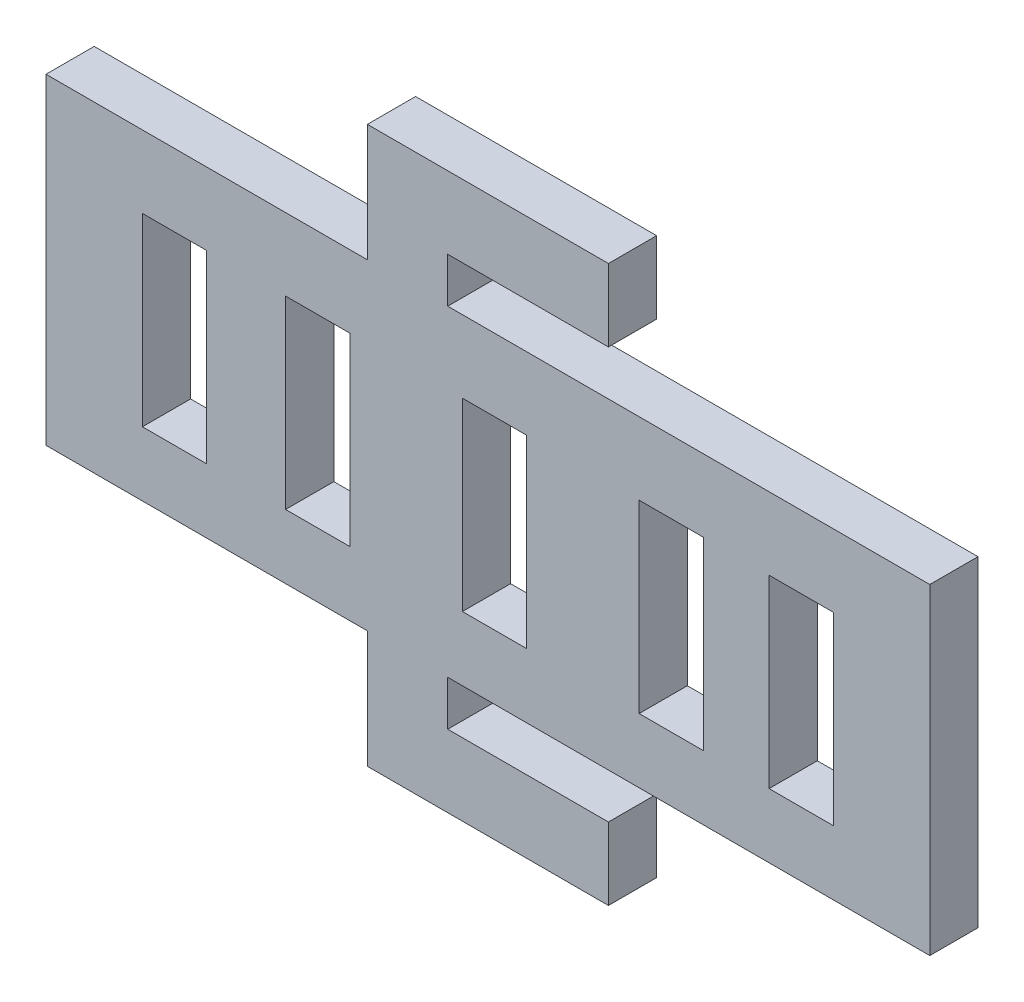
ISO-10303-21;
HEADER;
FILE_DESCRIPTION(('STEP AP214'),'2;1');
FILE_NAME('part.step','',(''),(''),'','','');
FILE_SCHEMA(('AUTOMOTIVE_DESIGN { 1 0 10303 214 1 1 1 1 }'));
ENDSEC;
DATA;
#1=APPLICATION_CONTEXT('core data for automotive mechanical design processes');
#2=APPLICATION_PROTOCOL_DEFINITION('international standard','automotive_design',2000,#1);
#3=PRODUCT_CONTEXT('',#1,'mechanical');
#4=PRODUCT('Part','Part','',(#3));
#5=PRODUCT_RELATED_PRODUCT_CATEGORY('part','',(#4));
#6=PRODUCT_DEFINITION_FORMATION('','',#4);
#7=PRODUCT_DEFINITION_CONTEXT('part definition',#1,'design');
#8=PRODUCT_DEFINITION('design','',#6,#7);
#9=PRODUCT_DEFINITION_SHAPE('','',#8);
#10=(LENGTH_UNIT() NAMED_UNIT(*) SI_UNIT(.MILLI.,.METRE.));
#11=(NAMED_UNIT(*) PLANE_ANGLE_UNIT() SI_UNIT($,.RADIAN.));
#12=(NAMED_UNIT(*) SI_UNIT($,.STERADIAN.) SOLID_ANGLE_UNIT());
#13=UNCERTAINTY_MEASURE_WITH_UNIT(LENGTH_MEASURE(1.E-05),#10,'distance_accuracy_value','');
#14=(GEOMETRIC_REPRESENTATION_CONTEXT(3) GLOBAL_UNCERTAINTY_ASSIGNED_CONTEXT((#13)) GLOBAL_UNIT_ASSIGNED_CONTEXT((#10,
#11,#12)) REPRESENTATION_CONTEXT('',''));
#15=CARTESIAN_POINT('',(0.,0.,0.));
#16=DIRECTION('',(0.,0.,1.));
#17=DIRECTION('',(1.,0.,0.));
#18=AXIS2_PLACEMENT_3D('',#15,#16,#17);
#19=CARTESIAN_POINT('',(0.,5.50000000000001,3.));
#20=DIRECTION('',(0.,1.,0.));
#21=DIRECTION('',(-1.,0.,0.));
#22=AXIS2_PLACEMENT_3D('',#19,#20,#21);
#23=PLANE('',#22);
#24=DIRECTION('',(1.,0.,0.));
#25=VECTOR('',#24,1.);
#26=CARTESIAN_POINT('',(0.,5.50000000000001,0.));
#27=LINE('',#26,#25);
#28=CARTESIAN_POINT('',(17.5,5.5,0.));
#29=VERTEX_POINT('',#28);
#30=CARTESIAN_POINT('',(21.5,5.5,0.));
#31=VERTEX_POINT('',#30);
#32=EDGE_CURVE('E432',#29,#31,#27,.T.);
#33=ORIENTED_EDGE('',*,*,#32,.T.);
#34=DIRECTION('',(0.,0.,-1.));
#35=VECTOR('',#34,1.);
#36=CARTESIAN_POINT('',(21.5,5.5,3.));
#37=LINE('',#36,#35);
#38=CARTESIAN_POINT('',(21.5,5.5,3.));
#39=VERTEX_POINT('',#38);
#40=EDGE_CURVE('E11',#39,#31,#37,.T.);
#41=ORIENTED_EDGE('',*,*,#40,.F.);
#42=DIRECTION('',(1.,0.,0.));
#43=VECTOR('',#42,1.);
#44=CARTESIAN_POINT('',(0.,5.50000000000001,3.));
#45=LINE('',#44,#43);
#46=CARTESIAN_POINT('',(17.5,5.5,3.));
#47=VERTEX_POINT('',#46);
#48=EDGE_CURVE('E294',#47,#39,#45,.T.);
#49=ORIENTED_EDGE('',*,*,#48,.F.);
#50=DIRECTION('',(0.,0.,-1.));
#51=VECTOR('',#50,1.);
#52=CARTESIAN_POINT('',(17.5,5.5,3.));
#53=LINE('',#52,#51);
#54=EDGE_CURVE('E65',#47,#29,#53,.T.);
#55=ORIENTED_EDGE('',*,*,#54,.T.);
#56=EDGE_LOOP('',(#33,#41,#49,#55));
#57=FACE_BOUND('',#56,.T.);
#58=ADVANCED_FACE('F45',(#57),#23,.F.);
#59=CARTESIAN_POINT('',(21.5,0.,3.));
#60=DIRECTION('',(1.,0.,0.));
#61=DIRECTION('',(0.,0.,-1.));
#62=AXIS2_PLACEMENT_3D('',#59,#60,#61);
#63=PLANE('',#62);
#64=DIRECTION('',(0.,-1.,0.));
#65=VECTOR('',#64,1.);
#66=CARTESIAN_POINT('',(21.5,0.,0.));
#67=LINE('',#66,#65);
#68=CARTESIAN_POINT('',(21.5,-6.,0.));
#69=VERTEX_POINT('',#68);
#70=EDGE_CURVE('E301',#31,#69,#67,.T.);
#71=ORIENTED_EDGE('',*,*,#70,.T.);
#72=DIRECTION('',(0.,0.,-1.));
#73=VECTOR('',#72,1.);
#74=CARTESIAN_POINT('',(21.5,-6.,3.));
#75=LINE('',#74,#73);
#76=CARTESIAN_POINT('',(21.5,-6.,3.));
#77=VERTEX_POINT('',#76);
#78=EDGE_CURVE('E56',#77,#69,#75,.T.);
#79=ORIENTED_EDGE('',*,*,#78,.F.);
#80=DIRECTION('',(0.,-1.,0.));
#81=VECTOR('',#80,1.);
#82=CARTESIAN_POINT('',(21.5,0.,3.));
#83=LINE('',#82,#81);
#84=EDGE_CURVE('E288',#39,#77,#83,.T.);
#85=ORIENTED_EDGE('',*,*,#84,.F.);
#86=ORIENTED_EDGE('',*,*,#40,.T.);
#87=EDGE_LOOP('',(#71,#79,#85,#86));
#88=FACE_BOUND('',#87,.T.);
#89=ADVANCED_FACE('F300',(#88),#63,.F.);
#90=CARTESIAN_POINT('',(0.,-6.,3.));
#91=DIRECTION('',(0.,1.,0.));
#92=DIRECTION('',(0.,0.,1.));
#93=AXIS2_PLACEMENT_3D('',#90,#91,#92);
#94=PLANE('',#93);
#95=DIRECTION('',(1.,0.,0.));
#96=VECTOR('',#95,1.);
#97=CARTESIAN_POINT('',(0.,-6.,0.));
#98=LINE('',#97,#96);
#99=CARTESIAN_POINT('',(17.5,-6.,0.));
#100=VERTEX_POINT('',#99);
#101=EDGE_CURVE('E437',#100,#69,#98,.T.);
#102=ORIENTED_EDGE('',*,*,#101,.F.);
#103=DIRECTION('',(0.,0.,-1.));
#104=VECTOR('',#103,1.);
#105=CARTESIAN_POINT('',(17.5,-6.,3.));
#106=LINE('',#105,#104);
#107=CARTESIAN_POINT('',(17.5,-6.,3.));
#108=VERTEX_POINT('',#107);
#109=EDGE_CURVE('E175',#108,#100,#106,.T.);
#110=ORIENTED_EDGE('',*,*,#109,.F.);
#111=DIRECTION('',(1.,0.,0.));
#112=VECTOR('',#111,1.);
#113=CARTESIAN_POINT('',(0.,-6.,3.));
#114=LINE('',#113,#112);
#115=EDGE_CURVE('E293',#108,#77,#114,.T.);
#116=ORIENTED_EDGE('',*,*,#115,.T.);
#117=ORIENTED_EDGE('',*,*,#78,.T.);
#118=EDGE_LOOP('',(#102,#110,#116,#117));
#119=FACE_BOUND('',#118,.T.);
#120=ADVANCED_FACE('F306',(#119),#94,.T.);
#121=CARTESIAN_POINT('',(0.,5.5,3.));
#122=DIRECTION('',(0.,1.,0.));
#123=DIRECTION('',(0.,0.,1.));
#124=AXIS2_PLACEMENT_3D('',#121,#122,#123);
#125=PLANE('',#124);
#126=DIRECTION('',(1.,0.,0.));
#127=VECTOR('',#126,1.);
#128=CARTESIAN_POINT('',(0.,5.5,0.));
#129=LINE('',#128,#127);
#130=CARTESIAN_POINT('',(9.41208733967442,5.5,0.));
#131=VERTEX_POINT('',#130);
#132=CARTESIAN_POINT('',(13.4120873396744,5.5,0.));
#133=VERTEX_POINT('',#132);
#134=EDGE_CURVE('E416',#131,#133,#129,.T.);
#135=ORIENTED_EDGE('',*,*,#134,.T.);
#136=DIRECTION('',(0.,0.,-1.));
#137=VECTOR('',#136,1.);
#138=CARTESIAN_POINT('',(13.4120873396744,5.5,3.));
#139=LINE('',#138,#137);
#140=CARTESIAN_POINT('',(13.4120873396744,5.5,3.));
#141=VERTEX_POINT('',#140);
#142=EDGE_CURVE('E447',#141,#133,#139,.T.);
#143=ORIENTED_EDGE('',*,*,#142,.F.);
#144=DIRECTION('',(1.,0.,0.));
#145=VECTOR('',#144,1.);
#146=CARTESIAN_POINT('',(0.,5.5,3.));
#147=LINE('',#146,#145);
#148=CARTESIAN_POINT('',(9.41208733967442,5.5,3.));
#149=VERTEX_POINT('',#148);
#150=EDGE_CURVE('E670',#149,#141,#147,.T.);
#151=ORIENTED_EDGE('',*,*,#150,.F.);
#152=DIRECTION('',(0.,0.,-1.));
#153=VECTOR('',#152,1.);
#154=CARTESIAN_POINT('',(9.41208733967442,5.5,3.));
#155=LINE('',#154,#153);
#156=EDGE_CURVE('E450',#149,#131,#155,.T.);
#157=ORIENTED_EDGE('',*,*,#156,.T.);
#158=EDGE_LOOP('',(#135,#143,#151,#157));
#159=FACE_BOUND('',#158,.T.);
#160=ADVANCED_FACE('F701',(#159),#125,.F.);
#161=CARTESIAN_POINT('',(13.4120873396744,0.,3.));
#162=DIRECTION('',(1.,0.,0.));
#163=DIRECTION('',(0.,0.,-1.));
#164=AXIS2_PLACEMENT_3D('',#161,#162,#163);
#165=PLANE('',#164);
#166=DIRECTION('',(0.,-1.,0.));
#167=VECTOR('',#166,1.);
#168=CARTESIAN_POINT('',(13.4120873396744,0.,0.));
#169=LINE('',#168,#167);
#170=CARTESIAN_POINT('',(13.4120873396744,-6.,0.));
#171=VERTEX_POINT('',#170);
#172=EDGE_CURVE('E420',#133,#171,#169,.T.);
#173=ORIENTED_EDGE('',*,*,#172,.T.);
#174=DIRECTION('',(0.,0.,-1.));
#175=VECTOR('',#174,1.);
#176=CARTESIAN_POINT('',(13.4120873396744,-6.,3.));
#177=LINE('',#176,#175);
#178=CARTESIAN_POINT('',(13.4120873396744,-6.,3.));
#179=VERTEX_POINT('',#178);
#180=EDGE_CURVE('E457',#179,#171,#177,.T.);
#181=ORIENTED_EDGE('',*,*,#180,.F.);
#182=DIRECTION('',(0.,-1.,0.));
#183=VECTOR('',#182,1.);
#184=CARTESIAN_POINT('',(13.4120873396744,0.,3.));
#185=LINE('',#184,#183);
#186=EDGE_CURVE('E674',#141,#179,#185,.T.);
#187=ORIENTED_EDGE('',*,*,#186,.F.);
#188=ORIENTED_EDGE('',*,*,#142,.T.);
#189=EDGE_LOOP('',(#173,#181,#187,#188));
#190=FACE_BOUND('',#189,.T.);
#191=ADVANCED_FACE('F703',(#190),#165,.F.);
#192=CARTESIAN_POINT('',(0.,-6.,3.));
#193=DIRECTION('',(0.,1.,0.));
#194=DIRECTION('',(-1.,0.,0.));
#195=AXIS2_PLACEMENT_3D('',#192,#193,#194);
#196=PLANE('',#195);
#197=DIRECTION('',(1.,0.,0.));
#198=VECTOR('',#197,1.);
#199=CARTESIAN_POINT('',(0.,-6.,0.));
#200=LINE('',#199,#198);
#201=CARTESIAN_POINT('',(9.41208733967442,-6.,0.));
#202=VERTEX_POINT('',#201);
#203=EDGE_CURVE('E424',#202,#171,#200,.T.);
#204=ORIENTED_EDGE('',*,*,#203,.F.);
#205=DIRECTION('',(0.,0.,-1.));
#206=VECTOR('',#205,1.);
#207=CARTESIAN_POINT('',(9.41208733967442,-6.,3.));
#208=LINE('',#207,#206);
#209=CARTESIAN_POINT('',(9.41208733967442,-6.,3.));
#210=VERTEX_POINT('',#209);
#211=EDGE_CURVE('E453',#210,#202,#208,.T.);
#212=ORIENTED_EDGE('',*,*,#211,.F.);
#213=DIRECTION('',(1.,0.,0.));
#214=VECTOR('',#213,1.);
#215=CARTESIAN_POINT('',(0.,-6.,3.));
#216=LINE('',#215,#214);
#217=EDGE_CURVE('E677',#210,#179,#216,.T.);
#218=ORIENTED_EDGE('',*,*,#217,.T.);
#219=ORIENTED_EDGE('',*,*,#180,.T.);
#220=EDGE_LOOP('',(#204,#212,#218,#219));
#221=FACE_BOUND('',#220,.T.);
#222=ADVANCED_FACE('F696',(#221),#196,.T.);
#223=CARTESIAN_POINT('',(0.,5.5,3.));
#224=DIRECTION('',(0.,1.,0.));
#225=DIRECTION('',(0.,0.,1.));
#226=AXIS2_PLACEMENT_3D('',#223,#224,#225);
#227=PLANE('',#226);
#228=DIRECTION('',(1.,0.,0.));
#229=VECTOR('',#228,1.);
#230=CARTESIAN_POINT('',(0.,5.5,0.));
#231=LINE('',#230,#229);
#232=CARTESIAN_POINT('',(-1.58791266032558,5.5,0.));
#233=VERTEX_POINT('',#232);
#234=CARTESIAN_POINT('',(2.41208733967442,5.5,0.));
#235=VERTEX_POINT('',#234);
#236=EDGE_CURVE('E400',#233,#235,#231,.T.);
#237=ORIENTED_EDGE('',*,*,#236,.T.);
#238=DIRECTION('',(0.,0.,-1.));
#239=VECTOR('',#238,1.);
#240=CARTESIAN_POINT('',(2.41208733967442,5.5,3.));
#241=LINE('',#240,#239);
#242=CARTESIAN_POINT('',(2.41208733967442,5.5,3.));
#243=VERTEX_POINT('',#242);
#244=EDGE_CURVE('E454',#243,#235,#241,.T.);
#245=ORIENTED_EDGE('',*,*,#244,.F.);
#246=DIRECTION('',(1.,0.,0.));
#247=VECTOR('',#246,1.);
#248=CARTESIAN_POINT('',(0.,5.5,3.));
#249=LINE('',#248,#247);
#250=CARTESIAN_POINT('',(-1.58791266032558,5.5,3.));
#251=VERTEX_POINT('',#250);
#252=EDGE_CURVE('E655',#251,#243,#249,.T.);
#253=ORIENTED_EDGE('',*,*,#252,.F.);
#254=DIRECTION('',(0.,0.,-1.));
#255=VECTOR('',#254,1.);
#256=CARTESIAN_POINT('',(-1.58791266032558,5.5,3.));
#257=LINE('',#256,#255);
#258=EDGE_CURVE('E463',#251,#233,#257,.T.);
#259=ORIENTED_EDGE('',*,*,#258,.T.);
#260=EDGE_LOOP('',(#237,#245,#253,#259));
#261=FACE_BOUND('',#260,.T.);
#262=ADVANCED_FACE('F710',(#261),#227,.F.);
#263=CARTESIAN_POINT('',(2.41208733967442,0.,3.));
#264=DIRECTION('',(1.,0.,0.));
#265=DIRECTION('',(0.,1.,0.));
#266=AXIS2_PLACEMENT_3D('',#263,#264,#265);
#267=PLANE('',#266);
#268=DIRECTION('',(0.,-1.,0.));
#269=VECTOR('',#268,1.);
#270=CARTESIAN_POINT('',(2.41208733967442,0.,0.));
#271=LINE('',#270,#269);
#272=CARTESIAN_POINT('',(2.41208733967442,-6.,0.));
#273=VERTEX_POINT('',#272);
#274=EDGE_CURVE('E404',#235,#273,#271,.T.);
#275=ORIENTED_EDGE('',*,*,#274,.T.);
#276=DIRECTION('',(0.,0.,-1.));
#277=VECTOR('',#276,1.);
#278=CARTESIAN_POINT('',(2.41208733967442,-6.,3.));
#279=LINE('',#278,#277);
#280=CARTESIAN_POINT('',(2.41208733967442,-6.,3.));
#281=VERTEX_POINT('',#280);
#282=EDGE_CURVE('E470',#281,#273,#279,.T.);
#283=ORIENTED_EDGE('',*,*,#282,.F.);
#284=DIRECTION('',(0.,-1.,0.));
#285=VECTOR('',#284,1.);
#286=CARTESIAN_POINT('',(2.41208733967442,0.,3.));
#287=LINE('',#286,#285);
#288=EDGE_CURVE('E659',#243,#281,#287,.T.);
#289=ORIENTED_EDGE('',*,*,#288,.F.);
#290=ORIENTED_EDGE('',*,*,#244,.T.);
#291=EDGE_LOOP('',(#275,#283,#289,#290));
#292=FACE_BOUND('',#291,.T.);
#293=ADVANCED_FACE('F1063',(#292),#267,.F.);
#294=CARTESIAN_POINT('',(0.,-6.,3.));
#295=DIRECTION('',(0.,1.,0.));
#296=DIRECTION('',(0.,0.,1.));
#297=AXIS2_PLACEMENT_3D('',#294,#295,#296);
#298=PLANE('',#297);
#299=DIRECTION('',(1.,0.,0.));
#300=VECTOR('',#299,1.);
#301=CARTESIAN_POINT('',(0.,-6.,0.));
#302=LINE('',#301,#300);
#303=CARTESIAN_POINT('',(-1.58791266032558,-6.,0.));
#304=VERTEX_POINT('',#303);
#305=EDGE_CURVE('E408',#304,#273,#302,.T.);
#306=ORIENTED_EDGE('',*,*,#305,.F.);
#307=DIRECTION('',(0.,0.,-1.));
#308=VECTOR('',#307,1.);
#309=CARTESIAN_POINT('',(-1.58791266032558,-6.,3.));
#310=LINE('',#309,#308);
#311=CARTESIAN_POINT('',(-1.58791266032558,-6.,3.));
#312=VERTEX_POINT('',#311);
#313=EDGE_CURVE('E466',#312,#304,#310,.T.);
#314=ORIENTED_EDGE('',*,*,#313,.F.);
#315=DIRECTION('',(1.,0.,0.));
#316=VECTOR('',#315,1.);
#317=CARTESIAN_POINT('',(0.,-6.,3.));
#318=LINE('',#317,#316);
#319=EDGE_CURVE('E662',#312,#281,#318,.T.);
#320=ORIENTED_EDGE('',*,*,#319,.T.);
#321=ORIENTED_EDGE('',*,*,#282,.T.);
#322=EDGE_LOOP('',(#306,#314,#320,#321));
#323=FACE_BOUND('',#322,.T.);
#324=ADVANCED_FACE('F1053',(#323),#298,.T.);
#325=CARTESIAN_POINT('',(0.,5.5,3.));
#326=DIRECTION('',(0.,1.,0.));
#327=DIRECTION('',(0.,0.,1.));
#328=AXIS2_PLACEMENT_3D('',#325,#326,#327);
#329=PLANE('',#328);
#330=DIRECTION('',(1.,0.,0.));
#331=VECTOR('',#330,1.);
#332=CARTESIAN_POINT('',(0.,5.5,0.));
#333=LINE('',#332,#331);
#334=CARTESIAN_POINT('',(-12.5879126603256,5.5,0.));
#335=VERTEX_POINT('',#334);
#336=CARTESIAN_POINT('',(-8.58791266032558,5.5,0.));
#337=VERTEX_POINT('',#336);
#338=EDGE_CURVE('E384',#335,#337,#333,.T.);
#339=ORIENTED_EDGE('',*,*,#338,.T.);
#340=DIRECTION('',(0.,0.,-1.));
#341=VECTOR('',#340,1.);
#342=CARTESIAN_POINT('',(-8.58791266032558,5.5,3.));
#343=LINE('',#342,#341);
#344=CARTESIAN_POINT('',(-8.58791266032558,5.5,3.));
#345=VERTEX_POINT('',#344);
#346=EDGE_CURVE('E467',#345,#337,#343,.T.);
#347=ORIENTED_EDGE('',*,*,#346,.F.);
#348=DIRECTION('',(1.,0.,0.));
#349=VECTOR('',#348,1.);
#350=CARTESIAN_POINT('',(0.,5.5,3.));
#351=LINE('',#350,#349);
#352=CARTESIAN_POINT('',(-12.5879126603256,5.5,3.));
#353=VERTEX_POINT('',#352);
#354=EDGE_CURVE('E640',#353,#345,#351,.T.);
#355=ORIENTED_EDGE('',*,*,#354,.F.);
#356=DIRECTION('',(0.,0.,-1.));
#357=VECTOR('',#356,1.);
#358=CARTESIAN_POINT('',(-12.5879126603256,5.5,3.));
#359=LINE('',#358,#357);
#360=EDGE_CURVE('E476',#353,#335,#359,.T.);
#361=ORIENTED_EDGE('',*,*,#360,.T.);
#362=EDGE_LOOP('',(#339,#347,#355,#361));
#363=FACE_BOUND('',#362,.T.);
#364=ADVANCED_FACE('F1043',(#363),#329,.F.);
#365=CARTESIAN_POINT('',(-8.58791266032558,0.,3.));
#366=DIRECTION('',(1.,0.,0.));
#367=DIRECTION('',(0.,0.,-1.));
#368=AXIS2_PLACEMENT_3D('',#365,#366,#367);
#369=PLANE('',#368);
#370=DIRECTION('',(0.,-1.,0.));
#371=VECTOR('',#370,1.);
#372=CARTESIAN_POINT('',(-8.58791266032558,0.,0.));
#373=LINE('',#372,#371);
#374=CARTESIAN_POINT('',(-8.58791266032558,-6.,0.));
#375=VERTEX_POINT('',#374);
#376=EDGE_CURVE('E388',#337,#375,#373,.T.);
#377=ORIENTED_EDGE('',*,*,#376,.T.);
#378=DIRECTION('',(0.,0.,-1.));
#379=VECTOR('',#378,1.);
#380=CARTESIAN_POINT('',(-8.58791266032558,-6.,3.));
#381=LINE('',#380,#379);
#382=CARTESIAN_POINT('',(-8.58791266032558,-6.,3.));
#383=VERTEX_POINT('',#382);
#384=EDGE_CURVE('E483',#383,#375,#381,.T.);
#385=ORIENTED_EDGE('',*,*,#384,.F.);
#386=DIRECTION('',(0.,-1.,0.));
#387=VECTOR('',#386,1.);
#388=CARTESIAN_POINT('',(-8.58791266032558,0.,3.));
#389=LINE('',#388,#387);
#390=EDGE_CURVE('E644',#345,#383,#389,.T.);
#391=ORIENTED_EDGE('',*,*,#390,.F.);
#392=ORIENTED_EDGE('',*,*,#346,.T.);
#393=EDGE_LOOP('',(#377,#385,#391,#392));
#394=FACE_BOUND('',#393,.T.);
#395=ADVANCED_FACE('F1033',(#394),#369,.F.);
#396=CARTESIAN_POINT('',(0.,-6.,3.));
#397=DIRECTION('',(0.,1.,0.));
#398=DIRECTION('',(0.,0.,1.));
#399=AXIS2_PLACEMENT_3D('',#396,#397,#398);
#400=PLANE('',#399);
#401=DIRECTION('',(1.,0.,0.));
#402=VECTOR('',#401,1.);
#403=CARTESIAN_POINT('',(0.,-6.,0.));
#404=LINE('',#403,#402);
#405=CARTESIAN_POINT('',(-12.5879126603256,-6.,0.));
#406=VERTEX_POINT('',#405);
#407=EDGE_CURVE('E392',#406,#375,#404,.T.);
#408=ORIENTED_EDGE('',*,*,#407,.F.);
#409=DIRECTION('',(0.,0.,-1.));
#410=VECTOR('',#409,1.);
#411=CARTESIAN_POINT('',(-12.5879126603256,-6.,3.));
#412=LINE('',#411,#410);
#413=CARTESIAN_POINT('',(-12.5879126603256,-6.,3.));
#414=VERTEX_POINT('',#413);
#415=EDGE_CURVE('E479',#414,#406,#412,.T.);
#416=ORIENTED_EDGE('',*,*,#415,.F.);
#417=DIRECTION('',(1.,0.,0.));
#418=VECTOR('',#417,1.);
#419=CARTESIAN_POINT('',(0.,-6.,3.));
#420=LINE('',#419,#418);
#421=EDGE_CURVE('E647',#414,#383,#420,.T.);
#422=ORIENTED_EDGE('',*,*,#421,.T.);
#423=ORIENTED_EDGE('',*,*,#384,.T.);
#424=EDGE_LOOP('',(#408,#416,#422,#423));
#425=FACE_BOUND('',#424,.T.);
#426=ADVANCED_FACE('F1023',(#425),#400,.T.);
#427=CARTESIAN_POINT('',(0.,-6.,3.));
#428=DIRECTION('',(0.,-1.,0.));
#429=DIRECTION('',(1.,0.,0.));
#430=AXIS2_PLACEMENT_3D('',#427,#428,#429);
#431=PLANE('',#430);
#432=DIRECTION('',(-1.,0.,0.));
#433=VECTOR('',#432,1.);
#434=CARTESIAN_POINT('',(0.,-6.,0.));
#435=LINE('',#434,#433);
#436=CARTESIAN_POINT('',(-17.5,-6.,0.));
#437=VERTEX_POINT('',#436);
#438=CARTESIAN_POINT('',(-21.5,-6.,0.));
#439=VERTEX_POINT('',#438);
#440=EDGE_CURVE('E368',#437,#439,#435,.T.);
#441=ORIENTED_EDGE('',*,*,#440,.T.);
#442=DIRECTION('',(0.,0.,-1.));
#443=VECTOR('',#442,1.);
#444=CARTESIAN_POINT('',(-21.5,-6.,3.));
#445=LINE('',#444,#443);
#446=CARTESIAN_POINT('',(-21.5,-6.,3.));
#447=VERTEX_POINT('',#446);
#448=EDGE_CURVE('E480',#447,#439,#445,.T.);
#449=ORIENTED_EDGE('',*,*,#448,.F.);
#450=DIRECTION('',(-1.,0.,0.));
#451=VECTOR('',#450,1.);
#452=CARTESIAN_POINT('',(0.,-6.,3.));
#453=LINE('',#452,#451);
#454=CARTESIAN_POINT('',(-17.5,-6.,3.));
#455=VERTEX_POINT('',#454);
#456=EDGE_CURVE('E613',#455,#447,#453,.T.);
#457=ORIENTED_EDGE('',*,*,#456,.F.);
#458=DIRECTION('',(0.,0.,-1.));
#459=VECTOR('',#458,1.);
#460=CARTESIAN_POINT('',(-17.5,-6.,3.));
#461=LINE('',#460,#459);
#462=EDGE_CURVE('E489',#455,#437,#461,.T.);
#463=ORIENTED_EDGE('',*,*,#462,.T.);
#464=EDGE_LOOP('',(#441,#449,#457,#463));
#465=FACE_BOUND('',#464,.T.);
#466=ADVANCED_FACE('F1013',(#465),#431,.F.);
#467=CARTESIAN_POINT('',(-21.5,0.,3.));
#468=DIRECTION('',(-1.,0.,0.));
#469=DIRECTION('',(0.,-1.,0.));
#470=AXIS2_PLACEMENT_3D('',#467,#468,#469);
#471=PLANE('',#470);
#472=DIRECTION('',(0.,1.,0.));
#473=VECTOR('',#472,1.);
#474=CARTESIAN_POINT('',(-21.5,0.,0.));
#475=LINE('',#474,#473);
#476=CARTESIAN_POINT('',(-21.5,5.5,0.));
#477=VERTEX_POINT('',#476);
#478=EDGE_CURVE('E372',#439,#477,#475,.T.);
#479=ORIENTED_EDGE('',*,*,#478,.T.);
#480=DIRECTION('',(0.,0.,-1.));
#481=VECTOR('',#480,1.);
#482=CARTESIAN_POINT('',(-21.5,5.5,3.));
#483=LINE('',#482,#481);
#484=CARTESIAN_POINT('',(-21.5,5.5,3.));
#485=VERTEX_POINT('',#484);
#486=EDGE_CURVE('E495',#485,#477,#483,.T.);
#487=ORIENTED_EDGE('',*,*,#486,.F.);
#488=DIRECTION('',(0.,1.,0.));
#489=VECTOR('',#488,1.);
#490=CARTESIAN_POINT('',(-21.5,0.,3.));
#491=LINE('',#490,#489);
#492=EDGE_CURVE('E629',#447,#485,#491,.T.);
#493=ORIENTED_EDGE('',*,*,#492,.F.);
#494=ORIENTED_EDGE('',*,*,#448,.T.);
#495=EDGE_LOOP('',(#479,#487,#493,#494));
#496=FACE_BOUND('',#495,.T.);
#497=ADVANCED_FACE('F1003',(#496),#471,.F.);
#498=CARTESIAN_POINT('',(0.,5.5,3.));
#499=DIRECTION('',(0.,-1.,0.));
#500=DIRECTION('',(1.,0.,0.));
#501=AXIS2_PLACEMENT_3D('',#498,#499,#500);
#502=PLANE('',#501);
#503=DIRECTION('',(-1.,0.,0.));
#504=VECTOR('',#503,1.);
#505=CARTESIAN_POINT('',(0.,5.5,0.));
#506=LINE('',#505,#504);
#507=CARTESIAN_POINT('',(-17.5,5.5,0.));
#508=VERTEX_POINT('',#507);
#509=EDGE_CURVE('E376',#508,#477,#506,.T.);
#510=ORIENTED_EDGE('',*,*,#509,.F.);
#511=DIRECTION('',(0.,0.,-1.));
#512=VECTOR('',#511,1.);
#513=CARTESIAN_POINT('',(-17.5,5.5,3.));
#514=LINE('',#513,#512);
#515=CARTESIAN_POINT('',(-17.5,5.5,3.));
#516=VERTEX_POINT('',#515);
#517=EDGE_CURVE('E492',#516,#508,#514,.T.);
#518=ORIENTED_EDGE('',*,*,#517,.F.);
#519=DIRECTION('',(-1.,0.,0.));
#520=VECTOR('',#519,1.);
#521=CARTESIAN_POINT('',(0.,5.5,3.));
#522=LINE('',#521,#520);
#523=EDGE_CURVE('E632',#516,#485,#522,.T.);
#524=ORIENTED_EDGE('',*,*,#523,.T.);
#525=ORIENTED_EDGE('',*,*,#486,.T.);
#526=EDGE_LOOP('',(#510,#518,#524,#525));
#527=FACE_BOUND('',#526,.T.);
#528=ADVANCED_FACE('F995',(#527),#502,.T.);
#529=CARTESIAN_POINT('',(0.,-10.,3.));
#530=DIRECTION('',(0.,1.,0.));
#531=DIRECTION('',(0.,0.,1.));
#532=AXIS2_PLACEMENT_3D('',#529,#530,#531);
#533=PLANE('',#532);
#534=DIRECTION('',(1.,0.,0.));
#535=VECTOR('',#534,1.);
#536=CARTESIAN_POINT('',(0.,-10.,0.));
#537=LINE('',#536,#535);
#538=CARTESIAN_POINT('',(-27.5,-10.,0.));
#539=VERTEX_POINT('',#538);
#540=CARTESIAN_POINT('',(-7.5,-10.,0.));
#541=VERTEX_POINT('',#540);
#542=EDGE_CURVE('E315',#539,#541,#537,.T.);
#543=ORIENTED_EDGE('',*,*,#542,.T.);
#544=DIRECTION('',(0.,0.,-1.));
#545=VECTOR('',#544,1.);
#546=CARTESIAN_POINT('',(-7.5,-10.,3.));
#547=LINE('',#546,#545);
#548=CARTESIAN_POINT('',(-7.5,-10.,3.));
#549=VERTEX_POINT('',#548);
#550=EDGE_CURVE('E49',#549,#541,#547,.T.);
#551=ORIENTED_EDGE('',*,*,#550,.F.);
#552=DIRECTION('',(1.,0.,0.));
#553=VECTOR('',#552,1.);
#554=CARTESIAN_POINT('',(0.,-10.,3.));
#555=LINE('',#554,#553);
#556=CARTESIAN_POINT('',(-27.5,-10.,3.));
#557=VERTEX_POINT('',#556);
#558=EDGE_CURVE('E444',#557,#549,#555,.T.);
#559=ORIENTED_EDGE('',*,*,#558,.F.);
#560=DIRECTION('',(0.,0.,-1.));
#561=VECTOR('',#560,1.);
#562=CARTESIAN_POINT('',(-27.5,-10.,3.));
#563=LINE('',#562,#561);
#564=EDGE_CURVE('E311',#557,#539,#563,.T.);
#565=ORIENTED_EDGE('',*,*,#564,.T.);
#566=EDGE_LOOP('',(#543,#551,#559,#565));
#567=FACE_BOUND('',#566,.T.);
#568=ADVANCED_FACE('F557',(#567),#533,.F.);
#569=CARTESIAN_POINT('',(-7.50000000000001,0.,3.));
#570=DIRECTION('',(1.,0.,0.));
#571=DIRECTION('',(0.,1.,0.));
#572=AXIS2_PLACEMENT_3D('',#569,#570,#571);
#573=PLANE('',#572);
#574=DIRECTION('',(0.,-1.,0.));
#575=VECTOR('',#574,1.);
#576=CARTESIAN_POINT('',(-7.50000000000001,0.,0.));
#577=LINE('',#576,#575);
#578=CARTESIAN_POINT('',(-7.5,-17.3,0.));
#579=VERTEX_POINT('',#578);
#580=EDGE_CURVE('E319',#541,#579,#577,.T.);
#581=ORIENTED_EDGE('',*,*,#580,.T.);
#582=DIRECTION('',(0.,0.,-1.));
#583=VECTOR('',#582,1.);
#584=CARTESIAN_POINT('',(-7.5,-17.3,3.));
#585=LINE('',#584,#583);
#586=CARTESIAN_POINT('',(-7.5,-17.3,3.));
#587=VERTEX_POINT('',#586);
#588=EDGE_CURVE('E546',#587,#579,#585,.T.);
#589=ORIENTED_EDGE('',*,*,#588,.F.);
#590=DIRECTION('',(0.,-1.,0.));
#591=VECTOR('',#590,1.);
#592=CARTESIAN_POINT('',(-7.50000000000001,0.,3.));
#593=LINE('',#592,#591);
#594=EDGE_CURVE('E188',#549,#587,#593,.T.);
#595=ORIENTED_EDGE('',*,*,#594,.F.);
#596=ORIENTED_EDGE('',*,*,#550,.T.);
#597=EDGE_LOOP('',(#581,#589,#595,#596));
#598=FACE_BOUND('',#597,.T.);
#599=ADVANCED_FACE('F47',(#598),#573,.F.);
#600=CARTESIAN_POINT('',(0.,-17.3,3.));
#601=DIRECTION('',(0.,1.,0.));
#602=DIRECTION('',(0.,0.,1.));
#603=AXIS2_PLACEMENT_3D('',#600,#601,#602);
#604=PLANE('',#603);
#605=DIRECTION('',(1.,0.,0.));
#606=VECTOR('',#605,1.);
#607=CARTESIAN_POINT('',(0.,-17.3,0.));
#608=LINE('',#607,#606);
#609=CARTESIAN_POINT('',(7.5,-17.3,0.));
#610=VERTEX_POINT('',#609);
#611=EDGE_CURVE('E323',#579,#610,#608,.T.);
#612=ORIENTED_EDGE('',*,*,#611,.T.);
#613=DIRECTION('',(0.,0.,-1.));
#614=VECTOR('',#613,1.);
#615=CARTESIAN_POINT('',(7.5,-17.3,3.));
#616=LINE('',#615,#614);
#617=CARTESIAN_POINT('',(7.5,-17.3,3.));
#618=VERTEX_POINT('',#617);
#619=EDGE_CURVE('E543',#618,#610,#616,.T.);
#620=ORIENTED_EDGE('',*,*,#619,.F.);
#621=DIRECTION('',(1.,0.,0.));
#622=VECTOR('',#621,1.);
#623=CARTESIAN_POINT('',(0.,-17.3,3.));
#624=LINE('',#623,#622);
#625=EDGE_CURVE('E790',#587,#618,#624,.T.);
#626=ORIENTED_EDGE('',*,*,#625,.F.);
#627=ORIENTED_EDGE('',*,*,#588,.T.);
#628=EDGE_LOOP('',(#612,#620,#626,#627));
#629=FACE_BOUND('',#628,.T.);
#630=ADVANCED_FACE('F764',(#629),#604,.F.);
#631=CARTESIAN_POINT('',(7.5,0.,3.));
#632=DIRECTION('',(-1.,0.,0.));
#633=DIRECTION('',(0.,0.,1.));
#634=AXIS2_PLACEMENT_3D('',#631,#632,#633);
#635=PLANE('',#634);
#636=DIRECTION('',(0.,1.,0.));
#637=VECTOR('',#636,1.);
#638=CARTESIAN_POINT('',(7.5,0.,0.));
#639=LINE('',#638,#637);
#640=CARTESIAN_POINT('',(7.5,-12.8,0.));
#641=VERTEX_POINT('',#640);
#642=EDGE_CURVE('E326',#610,#641,#639,.T.);
#643=ORIENTED_EDGE('',*,*,#642,.T.);
#644=DIRECTION('',(0.,0.,-1.));
#645=VECTOR('',#644,1.);
#646=CARTESIAN_POINT('',(7.5,-12.8,3.));
#647=LINE('',#646,#645);
#648=CARTESIAN_POINT('',(7.5,-12.8,3.));
#649=VERTEX_POINT('',#648);
#650=EDGE_CURVE('E539',#649,#641,#647,.T.);
#651=ORIENTED_EDGE('',*,*,#650,.F.);
#652=DIRECTION('',(0.,1.,0.));
#653=VECTOR('',#652,1.);
#654=CARTESIAN_POINT('',(7.5,0.,3.));
#655=LINE('',#654,#653);
#656=EDGE_CURVE('E774',#618,#649,#655,.T.);
#657=ORIENTED_EDGE('',*,*,#656,.F.);
#658=ORIENTED_EDGE('',*,*,#619,.T.);
#659=EDGE_LOOP('',(#643,#651,#657,#658));
#660=FACE_BOUND('',#659,.T.);
#661=ADVANCED_FACE('F761',(#660),#635,.F.);
#662=CARTESIAN_POINT('',(0.,-12.8,3.));
#663=DIRECTION('',(0.,-1.,0.));
#664=DIRECTION('',(1.,0.,0.));
#665=AXIS2_PLACEMENT_3D('',#662,#663,#664);
#666=PLANE('',#665);
#667=DIRECTION('',(-1.,0.,0.));
#668=VECTOR('',#667,1.);
#669=CARTESIAN_POINT('',(0.,-12.8,0.));
#670=LINE('',#669,#668);
#671=CARTESIAN_POINT('',(-2.5,-12.8,0.));
#672=VERTEX_POINT('',#671);
#673=EDGE_CURVE('E329',#641,#672,#670,.T.);
#674=ORIENTED_EDGE('',*,*,#673,.T.);
#675=DIRECTION('',(0.,0.,-1.));
#676=VECTOR('',#675,1.);
#677=CARTESIAN_POINT('',(-2.5,-12.8,3.));
#678=LINE('',#677,#676);
#679=CARTESIAN_POINT('',(-2.5,-12.8,3.));
#680=VERTEX_POINT('',#679);
#681=EDGE_CURVE('E535',#680,#672,#678,.T.);
#682=ORIENTED_EDGE('',*,*,#681,.F.);
#683=DIRECTION('',(-1.,0.,0.));
#684=VECTOR('',#683,1.);
#685=CARTESIAN_POINT('',(0.,-12.8,3.));
#686=LINE('',#685,#684);
#687=EDGE_CURVE('E781',#649,#680,#686,.T.);
#688=ORIENTED_EDGE('',*,*,#687,.F.);
#689=ORIENTED_EDGE('',*,*,#650,.T.);
#690=EDGE_LOOP('',(#674,#682,#688,#689));
#691=FACE_BOUND('',#690,.T.);
#692=ADVANCED_FACE('F757',(#691),#666,.F.);
#693=CARTESIAN_POINT('',(-2.5,0.,3.));
#694=DIRECTION('',(-1.,0.,0.));
#695=DIRECTION('',(0.,0.,1.));
#696=AXIS2_PLACEMENT_3D('',#693,#694,#695);
#697=PLANE('',#696);
#698=DIRECTION('',(0.,1.,0.));
#699=VECTOR('',#698,1.);
#700=CARTESIAN_POINT('',(-2.5,0.,0.));
#701=LINE('',#700,#699);
#702=CARTESIAN_POINT('',(-2.5,-10.,0.));
#703=VERTEX_POINT('',#702);
#704=EDGE_CURVE('E332',#672,#703,#701,.T.);
#705=ORIENTED_EDGE('',*,*,#704,.T.);
#706=DIRECTION('',(0.,0.,-1.));
#707=VECTOR('',#706,1.);
#708=CARTESIAN_POINT('',(-2.5,-10.,3.));
#709=LINE('',#708,#707);
#710=CARTESIAN_POINT('',(-2.5,-10.,3.));
#711=VERTEX_POINT('',#710);
#712=EDGE_CURVE('E531',#711,#703,#709,.T.);
#713=ORIENTED_EDGE('',*,*,#712,.F.);
#714=DIRECTION('',(0.,1.,0.));
#715=VECTOR('',#714,1.);
#716=CARTESIAN_POINT('',(-2.5,0.,3.));
#717=LINE('',#716,#715);
#718=EDGE_CURVE('E779',#680,#711,#717,.T.);
#719=ORIENTED_EDGE('',*,*,#718,.F.);
#720=ORIENTED_EDGE('',*,*,#681,.T.);
#721=EDGE_LOOP('',(#705,#713,#719,#720));
#722=FACE_BOUND('',#721,.T.);
#723=ADVANCED_FACE('F751',(#722),#697,.F.);
#724=CARTESIAN_POINT('',(27.5,-10.,0.));
#725=VERTEX_POINT('',#724);
#726=EDGE_CURVE('E320',#703,#725,#537,.T.);
#727=ORIENTED_EDGE('',*,*,#726,.T.);
#728=DIRECTION('',(0.,0.,-1.));
#729=VECTOR('',#728,1.);
#730=CARTESIAN_POINT('',(27.5,-10.,3.));
#731=LINE('',#730,#729);
#732=CARTESIAN_POINT('',(27.5,-10.,3.));
#733=VERTEX_POINT('',#732);
#734=EDGE_CURVE('E527',#733,#725,#731,.T.);
#735=ORIENTED_EDGE('',*,*,#734,.F.);
#736=EDGE_CURVE('E607',#711,#733,#555,.T.);
#737=ORIENTED_EDGE('',*,*,#736,.F.);
#738=ORIENTED_EDGE('',*,*,#712,.T.);
#739=EDGE_LOOP('',(#727,#735,#737,#738));
#740=FACE_BOUND('',#739,.T.);
#741=ADVANCED_FACE('F579',(#740),#533,.F.);
#742=CARTESIAN_POINT('',(27.5,0.,3.));
#743=DIRECTION('',(-1.,0.,0.));
#744=DIRECTION('',(0.,0.,1.));
#745=AXIS2_PLACEMENT_3D('',#742,#743,#744);
#746=PLANE('',#745);
#747=DIRECTION('',(0.,1.,0.));
#748=VECTOR('',#747,1.);
#749=CARTESIAN_POINT('',(27.5,0.,0.));
#750=LINE('',#749,#748);
#751=CARTESIAN_POINT('',(27.5,10.,0.));
#752=VERTEX_POINT('',#751);
#753=EDGE_CURVE('E335',#725,#752,#750,.T.);
#754=ORIENTED_EDGE('',*,*,#753,.T.);
#755=DIRECTION('',(0.,0.,-1.));
#756=VECTOR('',#755,1.);
#757=CARTESIAN_POINT('',(27.5,10.,3.));
#758=LINE('',#757,#756);
#759=CARTESIAN_POINT('',(27.5,10.,3.));
#760=VERTEX_POINT('',#759);
#761=EDGE_CURVE('E524',#760,#752,#758,.T.);
#762=ORIENTED_EDGE('',*,*,#761,.F.);
#763=DIRECTION('',(0.,1.,0.));
#764=VECTOR('',#763,1.);
#765=CARTESIAN_POINT('',(27.5,0.,3.));
#766=LINE('',#765,#764);
#767=EDGE_CURVE('E588',#733,#760,#766,.T.);
#768=ORIENTED_EDGE('',*,*,#767,.F.);
#769=ORIENTED_EDGE('',*,*,#734,.T.);
#770=EDGE_LOOP('',(#754,#762,#768,#769));
#771=FACE_BOUND('',#770,.T.);
#772=ADVANCED_FACE('F586',(#771),#746,.F.);
#773=CARTESIAN_POINT('',(0.,10.,3.));
#774=DIRECTION('',(0.,1.,0.));
#775=DIRECTION('',(0.,0.,1.));
#776=AXIS2_PLACEMENT_3D('',#773,#774,#775);
#777=PLANE('',#776);
#778=DIRECTION('',(1.,0.,0.));
#779=VECTOR('',#778,1.);
#780=CARTESIAN_POINT('',(0.,10.,0.));
#781=LINE('',#780,#779);
#782=CARTESIAN_POINT('',(-2.5,10.,0.));
#783=VERTEX_POINT('',#782);
#784=EDGE_CURVE('E339',#783,#752,#781,.T.);
#785=ORIENTED_EDGE('',*,*,#784,.F.);
#786=DIRECTION('',(0.,0.,-1.));
#787=VECTOR('',#786,1.);
#788=CARTESIAN_POINT('',(-2.5,10.,3.));
#789=LINE('',#788,#787);
#790=CARTESIAN_POINT('',(-2.5,10.,3.));
#791=VERTEX_POINT('',#790);
#792=EDGE_CURVE('E521',#791,#783,#789,.T.);
#793=ORIENTED_EDGE('',*,*,#792,.F.);
#794=DIRECTION('',(1.,0.,0.));
#795=VECTOR('',#794,1.);
#796=CARTESIAN_POINT('',(0.,10.,3.));
#797=LINE('',#796,#795);
#798=EDGE_CURVE('E595',#791,#760,#797,.T.);
#799=ORIENTED_EDGE('',*,*,#798,.T.);
#800=ORIENTED_EDGE('',*,*,#761,.T.);
#801=EDGE_LOOP('',(#785,#793,#799,#800));
#802=FACE_BOUND('',#801,.T.);
#803=ADVANCED_FACE('F592',(#802),#777,.T.);
#804=CARTESIAN_POINT('',(-2.5,0.,3.));
#805=DIRECTION('',(1.,0.,0.));
#806=DIRECTION('',(0.,0.,-1.));
#807=AXIS2_PLACEMENT_3D('',#804,#805,#806);
#808=PLANE('',#807);
#809=DIRECTION('',(0.,-1.,0.));
#810=VECTOR('',#809,1.);
#811=CARTESIAN_POINT('',(-2.5,0.,0.));
#812=LINE('',#811,#810);
#813=CARTESIAN_POINT('',(-2.5,12.8,0.));
#814=VERTEX_POINT('',#813);
#815=EDGE_CURVE('E343',#814,#783,#812,.T.);
#816=ORIENTED_EDGE('',*,*,#815,.F.);
#817=DIRECTION('',(0.,0.,-1.));
#818=VECTOR('',#817,1.);
#819=CARTESIAN_POINT('',(-2.5,12.8,3.));
#820=LINE('',#819,#818);
#821=CARTESIAN_POINT('',(-2.5,12.8,3.));
#822=VERTEX_POINT('',#821);
#823=EDGE_CURVE('E518',#822,#814,#820,.T.);
#824=ORIENTED_EDGE('',*,*,#823,.F.);
#825=DIRECTION('',(0.,-1.,0.));
#826=VECTOR('',#825,1.);
#827=CARTESIAN_POINT('',(-2.5,0.,3.));
#828=LINE('',#827,#826);
#829=EDGE_CURVE('E600',#822,#791,#828,.T.);
#830=ORIENTED_EDGE('',*,*,#829,.T.);
#831=ORIENTED_EDGE('',*,*,#792,.T.);
#832=EDGE_LOOP('',(#816,#824,#830,#831));
#833=FACE_BOUND('',#832,.T.);
#834=ADVANCED_FACE('F739',(#833),#808,.T.);
#835=CARTESIAN_POINT('',(0.,12.8,3.));
#836=DIRECTION('',(0.,-1.,0.));
#837=DIRECTION('',(0.,0.,-1.));
#838=AXIS2_PLACEMENT_3D('',#835,#836,#837);
#839=PLANE('',#838);
#840=DIRECTION('',(-1.,0.,0.));
#841=VECTOR('',#840,1.);
#842=CARTESIAN_POINT('',(0.,12.8,0.));
#843=LINE('',#842,#841);
#844=CARTESIAN_POINT('',(7.49999999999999,12.8,0.));
#845=VERTEX_POINT('',#844);
#846=EDGE_CURVE('E348',#845,#814,#843,.T.);
#847=ORIENTED_EDGE('',*,*,#846,.F.);
#848=DIRECTION('',(0.,0.,-1.));
#849=VECTOR('',#848,1.);
#850=CARTESIAN_POINT('',(7.49999999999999,12.8,3.));
#851=LINE('',#850,#849);
#852=CARTESIAN_POINT('',(7.49999999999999,12.8,3.));
#853=VERTEX_POINT('',#852);
#854=EDGE_CURVE('E515',#853,#845,#851,.T.);
#855=ORIENTED_EDGE('',*,*,#854,.F.);
#856=DIRECTION('',(-1.,0.,0.));
#857=VECTOR('',#856,1.);
#858=CARTESIAN_POINT('',(0.,12.8,3.));
#859=LINE('',#858,#857);
#860=EDGE_CURVE('E605',#853,#822,#859,.T.);
#861=ORIENTED_EDGE('',*,*,#860,.T.);
#862=ORIENTED_EDGE('',*,*,#823,.T.);
#863=EDGE_LOOP('',(#847,#855,#861,#862));
#864=FACE_BOUND('',#863,.T.);
#865=ADVANCED_FACE('F744',(#864),#839,.T.);
#866=CARTESIAN_POINT('',(7.5,0.,3.));
#867=DIRECTION('',(1.,0.,0.));
#868=DIRECTION('',(0.,1.,0.));
#869=AXIS2_PLACEMENT_3D('',#866,#867,#868);
#870=PLANE('',#869);
#871=DIRECTION('',(0.,-1.,0.));
#872=VECTOR('',#871,1.);
#873=CARTESIAN_POINT('',(7.5,0.,0.));
#874=LINE('',#873,#872);
#875=CARTESIAN_POINT('',(7.49999999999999,17.3,0.));
#876=VERTEX_POINT('',#875);
#877=EDGE_CURVE('E352',#876,#845,#874,.T.);
#878=ORIENTED_EDGE('',*,*,#877,.F.);
#879=DIRECTION('',(0.,0.,-1.));
#880=VECTOR('',#879,1.);
#881=CARTESIAN_POINT('',(7.49999999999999,17.3,3.));
#882=LINE('',#881,#880);
#883=CARTESIAN_POINT('',(7.49999999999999,17.3,3.));
#884=VERTEX_POINT('',#883);
#885=EDGE_CURVE('E512',#884,#876,#882,.T.);
#886=ORIENTED_EDGE('',*,*,#885,.F.);
#887=DIRECTION('',(0.,-1.,0.));
#888=VECTOR('',#887,1.);
#889=CARTESIAN_POINT('',(7.5,0.,3.));
#890=LINE('',#889,#888);
#891=EDGE_CURVE('E622',#884,#853,#890,.T.);
#892=ORIENTED_EDGE('',*,*,#891,.T.);
#893=ORIENTED_EDGE('',*,*,#854,.T.);
#894=EDGE_LOOP('',(#878,#886,#892,#893));
#895=FACE_BOUND('',#894,.T.);
#896=ADVANCED_FACE('F805',(#895),#870,.T.);
#897=CARTESIAN_POINT('',(0.,17.3,3.));
#898=DIRECTION('',(0.,1.,0.));
#899=DIRECTION('',(0.,0.,1.));
#900=AXIS2_PLACEMENT_3D('',#897,#898,#899);
#901=PLANE('',#900);
#902=DIRECTION('',(1.,0.,0.));
#903=VECTOR('',#902,1.);
#904=CARTESIAN_POINT('',(0.,17.3,0.));
#905=LINE('',#904,#903);
#906=CARTESIAN_POINT('',(-7.50000000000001,17.3,0.));
#907=VERTEX_POINT('',#906);
#908=EDGE_CURVE('E356',#907,#876,#905,.T.);
#909=ORIENTED_EDGE('',*,*,#908,.F.);
#910=DIRECTION('',(0.,0.,-1.));
#911=VECTOR('',#910,1.);
#912=CARTESIAN_POINT('',(-7.50000000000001,17.3,3.));
#913=LINE('',#912,#911);
#914=CARTESIAN_POINT('',(-7.50000000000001,17.3,3.));
#915=VERTEX_POINT('',#914);
#916=EDGE_CURVE('E509',#915,#907,#913,.T.);
#917=ORIENTED_EDGE('',*,*,#916,.F.);
#918=DIRECTION('',(1.,0.,0.));
#919=VECTOR('',#918,1.);
#920=CARTESIAN_POINT('',(0.,17.3,3.));
#921=LINE('',#920,#919);
#922=EDGE_CURVE('E616',#915,#884,#921,.T.);
#923=ORIENTED_EDGE('',*,*,#922,.T.);
#924=ORIENTED_EDGE('',*,*,#885,.T.);
#925=EDGE_LOOP('',(#909,#917,#923,#924));
#926=FACE_BOUND('',#925,.T.);
#927=ADVANCED_FACE('F735',(#926),#901,.T.);
#928=CARTESIAN_POINT('',(-7.5,0.,3.));
#929=DIRECTION('',(-1.,0.,0.));
#930=DIRECTION('',(0.,-1.,0.));
#931=AXIS2_PLACEMENT_3D('',#928,#929,#930);
#932=PLANE('',#931);
#933=DIRECTION('',(0.,1.,0.));
#934=VECTOR('',#933,1.);
#935=CARTESIAN_POINT('',(-7.5,0.,0.));
#936=LINE('',#935,#934);
#937=CARTESIAN_POINT('',(-7.50000000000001,10.,0.));
#938=VERTEX_POINT('',#937);
#939=EDGE_CURVE('E360',#938,#907,#936,.T.);
#940=ORIENTED_EDGE('',*,*,#939,.F.);
#941=DIRECTION('',(0.,0.,-1.));
#942=VECTOR('',#941,1.);
#943=CARTESIAN_POINT('',(-7.50000000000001,10.,3.));
#944=LINE('',#943,#942);
#945=CARTESIAN_POINT('',(-7.50000000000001,10.,3.));
#946=VERTEX_POINT('',#945);
#947=EDGE_CURVE('E506',#946,#938,#944,.T.);
#948=ORIENTED_EDGE('',*,*,#947,.F.);
#949=DIRECTION('',(0.,1.,0.));
#950=VECTOR('',#949,1.);
#951=CARTESIAN_POINT('',(-7.5,0.,3.));
#952=LINE('',#951,#950);
#953=EDGE_CURVE('E610',#946,#915,#952,.T.);
#954=ORIENTED_EDGE('',*,*,#953,.T.);
#955=ORIENTED_EDGE('',*,*,#916,.T.);
#956=EDGE_LOOP('',(#940,#948,#954,#955));
#957=FACE_BOUND('',#956,.T.);
#958=ADVANCED_FACE('F730',(#957),#932,.T.);
#959=CARTESIAN_POINT('',(-27.5,10.,0.));
#960=VERTEX_POINT('',#959);
#961=EDGE_CURVE('E344',#960,#938,#781,.T.);
#962=ORIENTED_EDGE('',*,*,#961,.F.);
#963=DIRECTION('',(0.,0.,-1.));
#964=VECTOR('',#963,1.);
#965=CARTESIAN_POINT('',(-27.5,10.,3.));
#966=LINE('',#965,#964);
#967=CARTESIAN_POINT('',(-27.5,10.,3.));
#968=VERTEX_POINT('',#967);
#969=EDGE_CURVE('E503',#968,#960,#966,.T.);
#970=ORIENTED_EDGE('',*,*,#969,.F.);
#971=EDGE_CURVE('E602',#968,#946,#797,.T.);
#972=ORIENTED_EDGE('',*,*,#971,.T.);
#973=ORIENTED_EDGE('',*,*,#947,.T.);
#974=EDGE_LOOP('',(#962,#970,#972,#973));
#975=FACE_BOUND('',#974,.T.);
#976=ADVANCED_FACE('F572',(#975),#777,.T.);
#977=CARTESIAN_POINT('',(9.41208733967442,0.,3.));
#978=DIRECTION('',(1.,0.,0.));
#979=DIRECTION('',(0.,1.,0.));
#980=AXIS2_PLACEMENT_3D('',#977,#978,#979);
#981=PLANE('',#980);
#982=DIRECTION('',(0.,-1.,0.));
#983=VECTOR('',#982,1.);
#984=CARTESIAN_POINT('',(9.41208733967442,0.,0.));
#985=LINE('',#984,#983);
#986=EDGE_CURVE('E428',#131,#202,#985,.T.);
#987=ORIENTED_EDGE('',*,*,#986,.F.);
#988=ORIENTED_EDGE('',*,*,#156,.F.);
#989=DIRECTION('',(0.,-1.,0.));
#990=VECTOR('',#989,1.);
#991=CARTESIAN_POINT('',(9.41208733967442,0.,3.));
#992=LINE('',#991,#990);
#993=EDGE_CURVE('E681',#149,#210,#992,.T.);
#994=ORIENTED_EDGE('',*,*,#993,.T.);
#995=ORIENTED_EDGE('',*,*,#211,.T.);
#996=EDGE_LOOP('',(#987,#988,#994,#995));
#997=FACE_BOUND('',#996,.T.);
#998=ADVANCED_FACE('F688',(#997),#981,.T.);
#999=CARTESIAN_POINT('',(-1.58791266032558,0.,3.));
#1000=DIRECTION('',(1.,0.,0.));
#1001=DIRECTION('',(0.,1.,0.));
#1002=AXIS2_PLACEMENT_3D('',#999,#1000,#1001);
#1003=PLANE('',#1002);
#1004=DIRECTION('',(0.,-1.,0.));
#1005=VECTOR('',#1004,1.);
#1006=CARTESIAN_POINT('',(-1.58791266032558,0.,0.));
#1007=LINE('',#1006,#1005);
#1008=EDGE_CURVE('E412',#233,#304,#1007,.T.);
#1009=ORIENTED_EDGE('',*,*,#1008,.F.);
#1010=ORIENTED_EDGE('',*,*,#258,.F.);
#1011=DIRECTION('',(0.,-1.,0.));
#1012=VECTOR('',#1011,1.);
#1013=CARTESIAN_POINT('',(-1.58791266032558,0.,3.));
#1014=LINE('',#1013,#1012);
#1015=EDGE_CURVE('E666',#251,#312,#1014,.T.);
#1016=ORIENTED_EDGE('',*,*,#1015,.T.);
#1017=ORIENTED_EDGE('',*,*,#313,.T.);
#1018=EDGE_LOOP('',(#1009,#1010,#1016,#1017));
#1019=FACE_BOUND('',#1018,.T.);
#1020=ADVANCED_FACE('F722',(#1019),#1003,.T.);
#1021=CARTESIAN_POINT('',(-12.5879126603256,0.,3.));
#1022=DIRECTION('',(1.,0.,0.));
#1023=DIRECTION('',(0.,1.,0.));
#1024=AXIS2_PLACEMENT_3D('',#1021,#1022,#1023);
#1025=PLANE('',#1024);
#1026=DIRECTION('',(0.,-1.,0.));
#1027=VECTOR('',#1026,1.);
#1028=CARTESIAN_POINT('',(-12.5879126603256,0.,0.));
#1029=LINE('',#1028,#1027);
#1030=EDGE_CURVE('E396',#335,#406,#1029,.T.);
#1031=ORIENTED_EDGE('',*,*,#1030,.F.);
#1032=ORIENTED_EDGE('',*,*,#360,.F.);
#1033=DIRECTION('',(0.,-1.,0.));
#1034=VECTOR('',#1033,1.);
#1035=CARTESIAN_POINT('',(-12.5879126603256,0.,3.));
#1036=LINE('',#1035,#1034);
#1037=EDGE_CURVE('E651',#353,#414,#1036,.T.);
#1038=ORIENTED_EDGE('',*,*,#1037,.T.);
#1039=ORIENTED_EDGE('',*,*,#415,.T.);
#1040=EDGE_LOOP('',(#1031,#1032,#1038,#1039));
#1041=FACE_BOUND('',#1040,.T.);
#1042=ADVANCED_FACE('F727',(#1041),#1025,.T.);
#1043=CARTESIAN_POINT('',(-17.5,0.,3.));
#1044=DIRECTION('',(-1.,0.,0.));
#1045=DIRECTION('',(0.,0.,1.));
#1046=AXIS2_PLACEMENT_3D('',#1043,#1044,#1045);
#1047=PLANE('',#1046);
#1048=DIRECTION('',(0.,1.,0.));
#1049=VECTOR('',#1048,1.);
#1050=CARTESIAN_POINT('',(-17.5,0.,0.));
#1051=LINE('',#1050,#1049);
#1052=EDGE_CURVE('E380',#437,#508,#1051,.T.);
#1053=ORIENTED_EDGE('',*,*,#1052,.F.);
#1054=ORIENTED_EDGE('',*,*,#462,.F.);
#1055=DIRECTION('',(0.,1.,0.));
#1056=VECTOR('',#1055,1.);
#1057=CARTESIAN_POINT('',(-17.5,0.,3.));
#1058=LINE('',#1057,#1056);
#1059=EDGE_CURVE('E636',#455,#516,#1058,.T.);
#1060=ORIENTED_EDGE('',*,*,#1059,.T.);
#1061=ORIENTED_EDGE('',*,*,#517,.T.);
#1062=EDGE_LOOP('',(#1053,#1054,#1060,#1061));
#1063=FACE_BOUND('',#1062,.T.);
#1064=ADVANCED_FACE('F853',(#1063),#1047,.T.);
#1065=CARTESIAN_POINT('',(-27.5,0.,3.));
#1066=DIRECTION('',(-1.,0.,0.));
#1067=DIRECTION('',(0.,0.,1.));
#1068=AXIS2_PLACEMENT_3D('',#1065,#1066,#1067);
#1069=PLANE('',#1068);
#1070=DIRECTION('',(0.,1.,0.));
#1071=VECTOR('',#1070,1.);
#1072=CARTESIAN_POINT('',(-27.5,0.,0.));
#1073=LINE('',#1072,#1071);
#1074=EDGE_CURVE('E364',#539,#960,#1073,.T.);
#1075=ORIENTED_EDGE('',*,*,#1074,.F.);
#1076=ORIENTED_EDGE('',*,*,#564,.F.);
#1077=DIRECTION('',(0.,1.,0.));
#1078=VECTOR('',#1077,1.);
#1079=CARTESIAN_POINT('',(-27.5,0.,3.));
#1080=LINE('',#1079,#1078);
#1081=EDGE_CURVE('E568',#557,#968,#1080,.T.);
#1082=ORIENTED_EDGE('',*,*,#1081,.T.);
#1083=ORIENTED_EDGE('',*,*,#969,.T.);
#1084=EDGE_LOOP('',(#1075,#1076,#1082,#1083));
#1085=FACE_BOUND('',#1084,.T.);
#1086=ADVANCED_FACE('F564',(#1085),#1069,.T.);
#1087=CARTESIAN_POINT('',(17.5,0.,3.));
#1088=DIRECTION('',(1.,0.,0.));
#1089=DIRECTION('',(0.,0.,-1.));
#1090=AXIS2_PLACEMENT_3D('',#1087,#1088,#1089);
#1091=PLANE('',#1090);
#1092=DIRECTION('',(0.,-1.,0.));
#1093=VECTOR('',#1092,1.);
#1094=CARTESIAN_POINT('',(17.5,0.,0.));
#1095=LINE('',#1094,#1093);
#1096=EDGE_CURVE('E440',#29,#100,#1095,.T.);
#1097=ORIENTED_EDGE('',*,*,#1096,.F.);
#1098=ORIENTED_EDGE('',*,*,#54,.F.);
#1099=DIRECTION('',(0.,-1.,0.));
#1100=VECTOR('',#1099,1.);
#1101=CARTESIAN_POINT('',(17.5,0.,3.));
#1102=LINE('',#1101,#1100);
#1103=EDGE_CURVE('E308',#47,#108,#1102,.T.);
#1104=ORIENTED_EDGE('',*,*,#1103,.T.);
#1105=ORIENTED_EDGE('',*,*,#109,.T.);
#1106=EDGE_LOOP('',(#1097,#1098,#1104,#1105));
#1107=FACE_BOUND('',#1106,.T.);
#1108=ADVANCED_FACE('F874',(#1107),#1091,.T.);
#1109=CARTESIAN_POINT('',(0.,0.,3.));
#1110=DIRECTION('',(0.,0.,1.));
#1111=DIRECTION('',(1.,0.,0.));
#1112=AXIS2_PLACEMENT_3D('',#1109,#1110,#1111);
#1113=PLANE('',#1112);
#1114=ORIENTED_EDGE('',*,*,#558,.T.);
#1115=ORIENTED_EDGE('',*,*,#594,.T.);
#1116=ORIENTED_EDGE('',*,*,#625,.T.);
#1117=ORIENTED_EDGE('',*,*,#656,.T.);
#1118=ORIENTED_EDGE('',*,*,#687,.T.);
#1119=ORIENTED_EDGE('',*,*,#718,.T.);
#1120=ORIENTED_EDGE('',*,*,#736,.T.);
#1121=ORIENTED_EDGE('',*,*,#767,.T.);
#1122=ORIENTED_EDGE('',*,*,#798,.F.);
#1123=ORIENTED_EDGE('',*,*,#829,.F.);
#1124=ORIENTED_EDGE('',*,*,#860,.F.);
#1125=ORIENTED_EDGE('',*,*,#891,.F.);
#1126=ORIENTED_EDGE('',*,*,#922,.F.);
#1127=ORIENTED_EDGE('',*,*,#953,.F.);
#1128=ORIENTED_EDGE('',*,*,#971,.F.);
#1129=ORIENTED_EDGE('',*,*,#1081,.F.);
#1130=EDGE_LOOP('',(#1114,#1115,#1116,#1117,#1118,#1119,#1120,#1121,#1122,#1123,#1124,#1125,
#1126,#1127,#1128,#1129));
#1131=FACE_BOUND('',#1130,.T.);
#1132=ORIENTED_EDGE('',*,*,#456,.T.);
#1133=ORIENTED_EDGE('',*,*,#492,.T.);
#1134=ORIENTED_EDGE('',*,*,#523,.F.);
#1135=ORIENTED_EDGE('',*,*,#1059,.F.);
#1136=EDGE_LOOP('',(#1132,#1133,#1134,#1135));
#1137=FACE_BOUND('',#1136,.T.);
#1138=ORIENTED_EDGE('',*,*,#354,.T.);
#1139=ORIENTED_EDGE('',*,*,#390,.T.);
#1140=ORIENTED_EDGE('',*,*,#421,.F.);
#1141=ORIENTED_EDGE('',*,*,#1037,.F.);
#1142=EDGE_LOOP('',(#1138,#1139,#1140,#1141));
#1143=FACE_BOUND('',#1142,.T.);
#1144=ORIENTED_EDGE('',*,*,#252,.T.);
#1145=ORIENTED_EDGE('',*,*,#288,.T.);
#1146=ORIENTED_EDGE('',*,*,#319,.F.);
#1147=ORIENTED_EDGE('',*,*,#1015,.F.);
#1148=EDGE_LOOP('',(#1144,#1145,#1146,#1147));
#1149=FACE_BOUND('',#1148,.T.);
#1150=ORIENTED_EDGE('',*,*,#150,.T.);
#1151=ORIENTED_EDGE('',*,*,#186,.T.);
#1152=ORIENTED_EDGE('',*,*,#217,.F.);
#1153=ORIENTED_EDGE('',*,*,#993,.F.);
#1154=EDGE_LOOP('',(#1150,#1151,#1152,#1153));
#1155=FACE_BOUND('',#1154,.T.);
#1156=ORIENTED_EDGE('',*,*,#48,.T.);
#1157=ORIENTED_EDGE('',*,*,#84,.T.);
#1158=ORIENTED_EDGE('',*,*,#115,.F.);
#1159=ORIENTED_EDGE('',*,*,#1103,.F.);
#1160=EDGE_LOOP('',(#1156,#1157,#1158,#1159));
#1161=FACE_BOUND('',#1160,.T.);
#1162=ADVANCED_FACE('F290',(#1131,#1137,#1143,#1149,#1155,#1161),#1113,.T.);
#1163=CARTESIAN_POINT('',(0.,0.,0.));
#1164=DIRECTION('',(0.,0.,1.));
#1165=DIRECTION('',(1.,0.,0.));
#1166=AXIS2_PLACEMENT_3D('',#1163,#1164,#1165);
#1167=PLANE('',#1166);
#1168=ORIENTED_EDGE('',*,*,#542,.F.);
#1169=ORIENTED_EDGE('',*,*,#1074,.T.);
#1170=ORIENTED_EDGE('',*,*,#961,.T.);
#1171=ORIENTED_EDGE('',*,*,#939,.T.);
#1172=ORIENTED_EDGE('',*,*,#908,.T.);
#1173=ORIENTED_EDGE('',*,*,#877,.T.);
#1174=ORIENTED_EDGE('',*,*,#846,.T.);
#1175=ORIENTED_EDGE('',*,*,#815,.T.);
#1176=ORIENTED_EDGE('',*,*,#784,.T.);
#1177=ORIENTED_EDGE('',*,*,#753,.F.);
#1178=ORIENTED_EDGE('',*,*,#726,.F.);
#1179=ORIENTED_EDGE('',*,*,#704,.F.);
#1180=ORIENTED_EDGE('',*,*,#673,.F.);
#1181=ORIENTED_EDGE('',*,*,#642,.F.);
#1182=ORIENTED_EDGE('',*,*,#611,.F.);
#1183=ORIENTED_EDGE('',*,*,#580,.F.);
#1184=EDGE_LOOP('',(#1168,#1169,#1170,#1171,#1172,#1173,#1174,#1175,#1176,#1177,#1178,#1179,
#1180,#1181,#1182,#1183));
#1185=FACE_BOUND('',#1184,.T.);
#1186=ORIENTED_EDGE('',*,*,#440,.F.);
#1187=ORIENTED_EDGE('',*,*,#1052,.T.);
#1188=ORIENTED_EDGE('',*,*,#509,.T.);
#1189=ORIENTED_EDGE('',*,*,#478,.F.);
#1190=EDGE_LOOP('',(#1186,#1187,#1188,#1189));
#1191=FACE_BOUND('',#1190,.T.);
#1192=ORIENTED_EDGE('',*,*,#338,.F.);
#1193=ORIENTED_EDGE('',*,*,#1030,.T.);
#1194=ORIENTED_EDGE('',*,*,#407,.T.);
#1195=ORIENTED_EDGE('',*,*,#376,.F.);
#1196=EDGE_LOOP('',(#1192,#1193,#1194,#1195));
#1197=FACE_BOUND('',#1196,.T.);
#1198=ORIENTED_EDGE('',*,*,#236,.F.);
#1199=ORIENTED_EDGE('',*,*,#1008,.T.);
#1200=ORIENTED_EDGE('',*,*,#305,.T.);
#1201=ORIENTED_EDGE('',*,*,#274,.F.);
#1202=EDGE_LOOP('',(#1198,#1199,#1200,#1201));
#1203=FACE_BOUND('',#1202,.T.);
#1204=ORIENTED_EDGE('',*,*,#134,.F.);
#1205=ORIENTED_EDGE('',*,*,#986,.T.);
#1206=ORIENTED_EDGE('',*,*,#203,.T.);
#1207=ORIENTED_EDGE('',*,*,#172,.F.);
#1208=EDGE_LOOP('',(#1204,#1205,#1206,#1207));
#1209=FACE_BOUND('',#1208,.T.);
#1210=ORIENTED_EDGE('',*,*,#32,.F.);
#1211=ORIENTED_EDGE('',*,*,#1096,.T.);
#1212=ORIENTED_EDGE('',*,*,#101,.T.);
#1213=ORIENTED_EDGE('',*,*,#70,.F.);
#1214=EDGE_LOOP('',(#1210,#1211,#1212,#1213));
#1215=FACE_BOUND('',#1214,.T.);
#1216=ADVANCED_FACE('F560',(#1185,#1191,#1197,#1203,#1209,#1215),#1167,.F.);
#1217=CLOSED_SHELL('',(#58,#89,#120,#160,#191,#222,#262,#293,#324,#364,#395,#426,#466,#497,#528,
#568,#599,#630,#661,#692,#723,#741,#772,#803,#834,#865,#896,#927,#958,#976,#998,#1020,#1042,
#1064,#1086,#1108,#1162,#1216));
#1218=MANIFOLD_SOLID_BREP('B2',#1217);
#1219=ADVANCED_BREP_SHAPE_REPRESENTATION('',(#18,#1218),#14);
#1220=SHAPE_DEFINITION_REPRESENTATION(#9,#1219);
ENDSEC;
END-ISO-10303-21;
